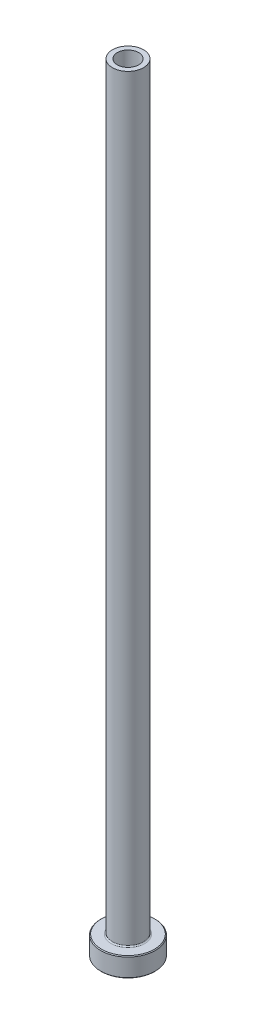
from build123d import *

# Parameters (mm, degrees)
FILLET1_R     = 0.3
CHAMFER1_SIZE = 0.2
CHAMFER3_SIZE = 0.5


with BuildPart() as part:
    # Sketch1 → Revolve1 (revolve)
    with BuildSketch(Plane.XY, mode=Mode.PRIVATE) as revolve1_sk:
        Polygon((-2.75, 200), (-4, 200), (-4, 5), (-7, 5), (-7, 0), (-3, 0), (-3, 143), (-2.75, 155), align=None)
    revolve(revolve1_sk.sketch.rotate(Axis((0, 92.187680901, 0), (0, -1, 0)), 270), axis=Axis((0, 92.187680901, 0), (0, -1, 0)))

    # Fillet1
    fillet1_edges = [part.edges().sort_by_distance(p)[0] for p in [
        (0, 5, -4),
    ]]
    fillet(fillet1_edges, radius=FILLET1_R)

    # Chamfer1
    chamfer1_edges = [part.edges().sort_by_distance(p)[0] for p in [
        (0, 0, -7),
        (0, 5, -7),
    ]]
    chamfer(chamfer1_edges, length=CHAMFER1_SIZE)

    # Chamfer3
    chamfer3_edges = [part.edges().sort_by_distance(p)[0] for p in [
        (0, 0, -3),
    ]]
    chamfer(chamfer3_edges, length=CHAMFER3_SIZE)


solid = part.part
